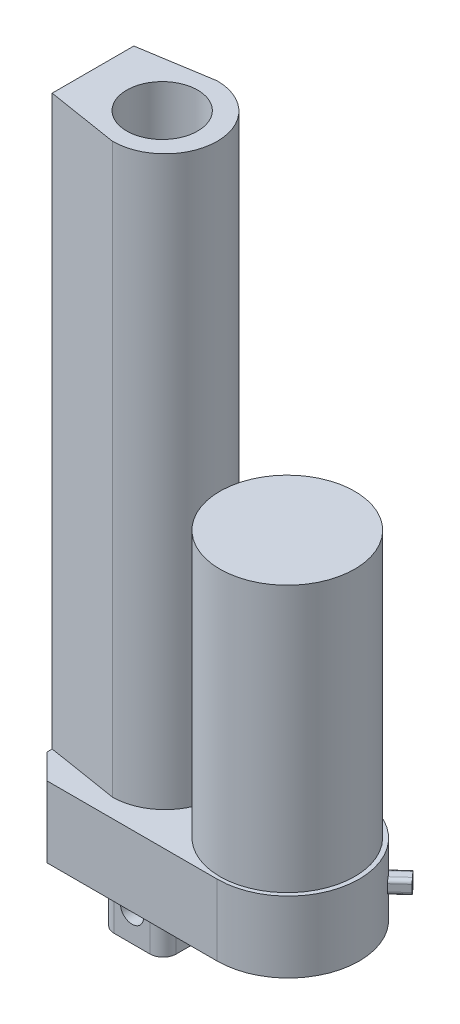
from build123d import *

# Parameters (mm, degrees)
BOSS_EXTRUDE1_DEPTH      = 20
SKETCH3_R                = 14.75
SKETCH3_W                = 20.25
SKETCH3_H                = 29.5
BOSS_EXTRUDE2_DEPTH      = 160
SKETCH4_R                = 19
BOSS_EXTRUDE3_DEPTH      = 75
SKETCH6_W                = 17.5
SKETCH6_H                = 17.5
BOSS_EXTRUDE4_DEPTH      = 19
SKETCH8_R                = 10
CUT_EXTRUDE1_DEPTH       = 160
SKETCH10_R               = 3.25
CUT_EXTRUDE2_DEPTH       = 200.060292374
FILLET1_R                = 3.7
BOSS_EXTRUDE5_DEPTH      = 2
BOSS_EXTRUDE5_DEPTH_BACK = 2
FILLET2_R                = 1
CHAMFER1_SIZE            = 7


with BuildPart() as part:
    # Sketch2 → Boss-Extrude1 (new body)
    with BuildSketch(Plane(origin=(0, 0, 0), x_dir=(1, 0, 0), z_dir=(0, 1, 0))):
        with BuildLine():
            Line((0, 0), (55, 0))
            ThreePointArc((55, 0), (75, 20), (55, 40))
            Line((55, 40), (0, 40))
            Line((0, 40), (0, 0))
        make_face()
    extrude(amount=BOSS_EXTRUDE1_DEPTH)

    # Sketch3 → Boss-Extrude2 (add)
    with BuildSketch(Plane(origin=(0, 20, 0), x_dir=(1, 0, 0), z_dir=(0, 1, 0))):
        with Locations((20.25, 20)):
            Circle(SKETCH3_R)
        with Locations((10.125, 20)):
            Rectangle(SKETCH3_W, SKETCH3_H)
    extrude(amount=BOSS_EXTRUDE2_DEPTH)

    # Sketch4 → Boss-Extrude3 (add)
    with BuildSketch(Plane(origin=(0, 20, 0), x_dir=(1, 0, 0), z_dir=(0, 1, 0))):
        with Locations(Location((54.740208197, 20, 0), (0, 0, 270))):
            Circle(SKETCH4_R)
    extrude(amount=BOSS_EXTRUDE3_DEPTH)

    # Sketch6 → Boss-Extrude4 (add)
    with BuildSketch(Plane(origin=(0, 0, 0), x_dir=(-1, 0, 0), z_dir=(0, -1, 0))):
        with Locations((-19.75, 20)):
            Rectangle(SKETCH6_W, SKETCH6_H)
    extrude(amount=BOSS_EXTRUDE4_DEPTH)

    # Sketch8 → Cut-Extrude1 (cut)
    with BuildSketch(Plane(origin=(0, 180, 0), x_dir=(1, 0, 0), z_dir=(0, 1, 0))):
        with Locations(Location((19.75, 19.75211552, 0), (0, 0, 270))):
            Circle(SKETCH8_R)
        Polygon((0, 31.5), (0, 34.75), (20.25, 34.75), align=None)
        Polygon((0, 8.5), (0, 5.25), (20.25, 5.25), align=None)
    extrude(amount=-CUT_EXTRUDE1_DEPTH, mode=Mode.SUBTRACT)

    # Sketch10 → Cut-Extrude2 (cut, through all)
    with BuildSketch(Plane.XY):
        with Locations((19.75, -11)):
            Circle(SKETCH10_R)
    extrude(amount=-CUT_EXTRUDE2_DEPTH, mode=Mode.SUBTRACT)

    # Fillet1
    fillet1_edges = [part.edges().sort_by_distance(p)[0] for p in [
        (11, -9.5, -11.25),
        (11, -9.5, -28.75),
        (28.5, -9.5, -28.75),
        (28.5, -9.5, -11.25),
    ]]
    fillet(fillet1_edges, radius=FILLET1_R)

    # Sketch11 → Boss-Extrude5 (add, two sides: drawn at the far end of the back side and taken through both)
    with BuildSketch(Plane(origin=(0, 10, 0), x_dir=(-1, 0, 0), z_dir=(0, -1, 0)).offset(-BOSS_EXTRUDE5_DEPTH_BACK)):
        Polygon((-63.261258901, 30.183854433), (-72.047598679, 38.144632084), (-74.73333501, 35.180374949), (-66.022842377, 27.288317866), align=None)
    extrude(amount=BOSS_EXTRUDE5_DEPTH + BOSS_EXTRUDE5_DEPTH_BACK)

    # Fillet2
    fillet2_edges = [part.edges().sort_by_distance(p)[0] for p in [
        (72.911598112, 12, -33.529807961),
        (70.225861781, 12, -36.494065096),
        (70.225861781, 8, -36.494065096),
        (72.911598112, 8, -33.529807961),
    ]]
    fillet(fillet2_edges, radius=FILLET2_R)

    # Chamfer1
    chamfer1_edges = [part.edges().sort_by_distance(p)[0] for p in [
        (0, 10, -40),
        (0, 10, 0),
    ]]
    chamfer(chamfer1_edges, length=CHAMFER1_SIZE)


solid = part.part
